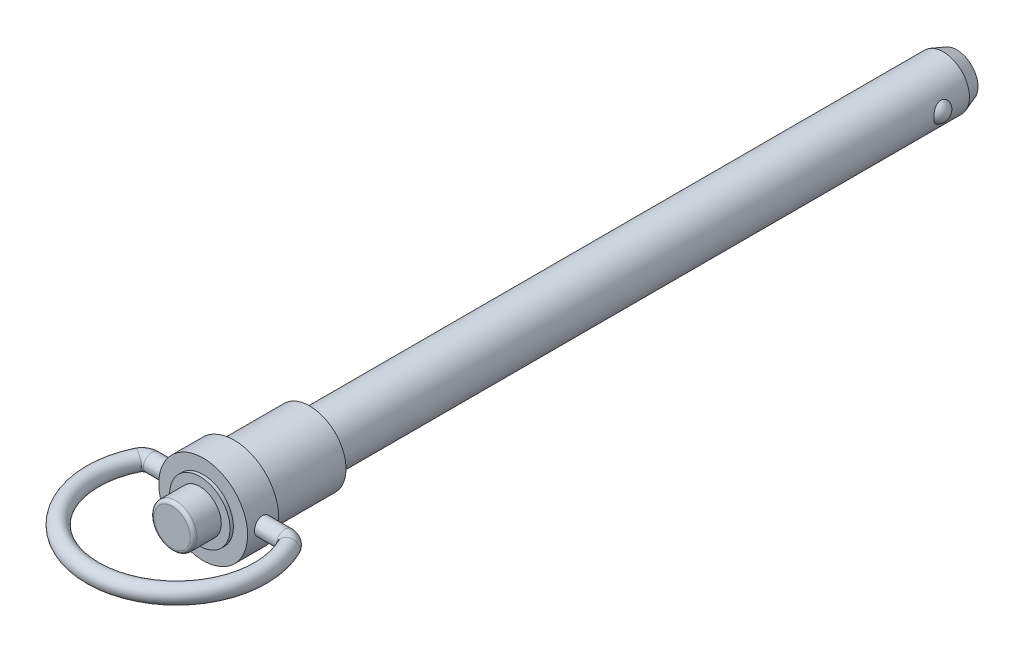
ISO-10303-21;
HEADER;
FILE_DESCRIPTION(('STEP AP214'),'2;1');
FILE_NAME('part.step','',(''),(''),'','','');
FILE_SCHEMA(('AUTOMOTIVE_DESIGN { 1 0 10303 214 1 1 1 1 }'));
ENDSEC;
DATA;
#1=APPLICATION_CONTEXT('core data for automotive mechanical design processes');
#2=APPLICATION_PROTOCOL_DEFINITION('international standard','automotive_design',2000,#1);
#3=PRODUCT_CONTEXT('',#1,'mechanical');
#4=PRODUCT('Part','Part','',(#3));
#5=PRODUCT_RELATED_PRODUCT_CATEGORY('part','',(#4));
#6=PRODUCT_DEFINITION_FORMATION('','',#4);
#7=PRODUCT_DEFINITION_CONTEXT('part definition',#1,'design');
#8=PRODUCT_DEFINITION('design','',#6,#7);
#9=PRODUCT_DEFINITION_SHAPE('','',#8);
#10=(LENGTH_UNIT() NAMED_UNIT(*) SI_UNIT(.MILLI.,.METRE.));
#11=(NAMED_UNIT(*) PLANE_ANGLE_UNIT() SI_UNIT($,.RADIAN.));
#12=(NAMED_UNIT(*) SI_UNIT($,.STERADIAN.) SOLID_ANGLE_UNIT());
#13=UNCERTAINTY_MEASURE_WITH_UNIT(LENGTH_MEASURE(1.E-05),#10,'distance_accuracy_value','');
#14=(GEOMETRIC_REPRESENTATION_CONTEXT(3) GLOBAL_UNCERTAINTY_ASSIGNED_CONTEXT((#13)) GLOBAL_UNIT_ASSIGNED_CONTEXT((#10,
#11,#12)) REPRESENTATION_CONTEXT('',''));
#15=CARTESIAN_POINT('',(0.,0.,0.));
#16=DIRECTION('',(0.,0.,1.));
#17=DIRECTION('',(1.,0.,0.));
#18=AXIS2_PLACEMENT_3D('',#15,#16,#17);
#19=CARTESIAN_POINT('',(0.,0.,20.828));
#20=DIRECTION('',(0.,0.,1.));
#21=DIRECTION('',(0.,-1.,0.));
#22=AXIS2_PLACEMENT_3D('',#19,#20,#21);
#23=PLANE('',#22);
#24=CARTESIAN_POINT('',(0.,0.,20.828));
#25=DIRECTION('',(0.,0.,-1.));
#26=DIRECTION('',(0.,1.,0.));
#27=AXIS2_PLACEMENT_3D('',#24,#25,#26);
#28=CIRCLE('',#27,2.7432);
#29=CARTESIAN_POINT('',(0.,2.7432,20.828));
#30=VERTEX_POINT('',#29);
#31=CARTESIAN_POINT('',(0.,-2.7432,20.828));
#32=VERTEX_POINT('',#31);
#33=EDGE_CURVE('E34',#30,#32,#28,.T.);
#34=ORIENTED_EDGE('',*,*,#33,.F.);
#35=CARTESIAN_POINT('',(0.,0.,20.828));
#36=DIRECTION('',(0.,0.,-1.));
#37=DIRECTION('',(0.,-1.,0.));
#38=AXIS2_PLACEMENT_3D('',#35,#36,#37);
#39=CIRCLE('',#38,2.7432);
#40=EDGE_CURVE('E29',#32,#30,#39,.T.);
#41=ORIENTED_EDGE('',*,*,#40,.F.);
#42=EDGE_LOOP('',(#34,#41));
#43=FACE_BOUND('',#42,.T.);
#44=ADVANCED_FACE('F15',(#43),#23,.T.);
#45=CARTESIAN_POINT('',(0.,0.,20.32));
#46=DIRECTION('',(0.,0.,1.));
#47=DIRECTION('',(0.,-1.,0.));
#48=AXIS2_PLACEMENT_3D('',#45,#46,#47);
#49=TOROIDAL_SURFACE('',#48,2.7432,0.508);
#50=ORIENTED_EDGE('',*,*,#40,.T.);
#51=ORIENTED_EDGE('',*,*,#33,.T.);
#52=EDGE_LOOP('',(#50,#51));
#53=FACE_BOUND('',#52,.T.);
#54=CARTESIAN_POINT('',(0.,0.,20.32));
#55=DIRECTION('',(0.,0.,-1.));
#56=DIRECTION('',(0.,1.,0.));
#57=AXIS2_PLACEMENT_3D('',#54,#55,#56);
#58=CIRCLE('',#57,3.2512);
#59=CARTESIAN_POINT('',(0.,3.2512,20.32));
#60=VERTEX_POINT('',#59);
#61=EDGE_CURVE('E51',#60,#60,#58,.T.);
#62=ORIENTED_EDGE('',*,*,#61,.F.);
#63=EDGE_LOOP('',(#62));
#64=FACE_BOUND('',#63,.T.);
#65=ADVANCED_FACE('F40',(#53,#64),#49,.T.);
#66=CARTESIAN_POINT('',(0.,0.,20.828));
#67=DIRECTION('',(0.,0.,-1.));
#68=DIRECTION('',(0.,1.,0.));
#69=AXIS2_PLACEMENT_3D('',#66,#67,#68);
#70=CYLINDRICAL_SURFACE('',#69,3.2512);
#71=CARTESIAN_POINT('',(0.,0.,16.637));
#72=DIRECTION('',(0.,0.,-1.));
#73=DIRECTION('',(0.,1.,0.));
#74=AXIS2_PLACEMENT_3D('',#71,#72,#73);
#75=CIRCLE('',#74,3.2512);
#76=CARTESIAN_POINT('',(0.,3.2512,16.637));
#77=VERTEX_POINT('',#76);
#78=EDGE_CURVE('E60',#77,#77,#75,.T.);
#79=ORIENTED_EDGE('',*,*,#78,.F.);
#80=EDGE_LOOP('',(#79));
#81=FACE_BOUND('',#80,.T.);
#82=ORIENTED_EDGE('',*,*,#61,.T.);
#83=EDGE_LOOP('',(#82));
#84=FACE_BOUND('',#83,.T.);
#85=ADVANCED_FACE('F80',(#81,#84),#70,.T.);
#86=CARTESIAN_POINT('',(4.572,0.,16.637));
#87=DIRECTION('',(0.,0.,1.));
#88=DIRECTION('',(0.,-1.,0.));
#89=AXIS2_PLACEMENT_3D('',#86,#87,#88);
#90=PLANE('',#89);
#91=ORIENTED_EDGE('',*,*,#78,.T.);
#92=EDGE_LOOP('',(#91));
#93=FACE_BOUND('',#92,.T.);
#94=CARTESIAN_POINT('',(0.,0.,16.637));
#95=DIRECTION('',(0.,0.,-1.));
#96=DIRECTION('',(0.,1.,0.));
#97=AXIS2_PLACEMENT_3D('',#94,#95,#96);
#98=CIRCLE('',#97,4.572);
#99=CARTESIAN_POINT('',(0.,4.572,16.637));
#100=VERTEX_POINT('',#99);
#101=EDGE_CURVE('E64',#100,#100,#98,.T.);
#102=ORIENTED_EDGE('',*,*,#101,.F.);
#103=EDGE_LOOP('',(#102));
#104=FACE_BOUND('',#103,.T.);
#105=ADVANCED_FACE('F83',(#93,#104),#90,.T.);
#106=CARTESIAN_POINT('',(0.,0.,0.));
#107=DIRECTION('',(0.,0.,-1.));
#108=DIRECTION('',(0.,1.,0.));
#109=AXIS2_PLACEMENT_3D('',#106,#107,#108);
#110=CYLINDRICAL_SURFACE('',#109,4.572);
#111=ORIENTED_EDGE('',*,*,#101,.T.);
#112=EDGE_LOOP('',(#111));
#113=FACE_BOUND('',#112,.T.);
#114=CARTESIAN_POINT('',(0.,0.,16.129));
#115=DIRECTION('',(0.,0.,-1.));
#116=DIRECTION('',(0.,1.,0.));
#117=AXIS2_PLACEMENT_3D('',#114,#115,#116);
#118=CIRCLE('',#117,4.572);
#119=CARTESIAN_POINT('',(0.,4.572,16.129));
#120=VERTEX_POINT('',#119);
#121=EDGE_CURVE('E218',#120,#120,#118,.T.);
#122=ORIENTED_EDGE('',*,*,#121,.F.);
#123=EDGE_LOOP('',(#122));
#124=FACE_BOUND('',#123,.T.);
#125=ADVANCED_FACE('F182',(#113,#124),#110,.T.);
#126=CARTESIAN_POINT('',(6.731,0.,16.129));
#127=DIRECTION('',(0.,0.,1.));
#128=DIRECTION('',(0.,-1.,0.));
#129=AXIS2_PLACEMENT_3D('',#126,#127,#128);
#130=PLANE('',#129);
#131=CARTESIAN_POINT('',(0.,0.,16.129));
#132=DIRECTION('',(0.,0.,-1.));
#133=DIRECTION('',(0.,1.,0.));
#134=AXIS2_PLACEMENT_3D('',#131,#132,#133);
#135=CIRCLE('',#134,6.731);
#136=CARTESIAN_POINT('',(0.,6.731,16.129));
#137=VERTEX_POINT('',#136);
#138=EDGE_CURVE('E221',#137,#137,#135,.T.);
#139=ORIENTED_EDGE('',*,*,#138,.F.);
#140=EDGE_LOOP('',(#139));
#141=FACE_BOUND('',#140,.T.);
#142=ORIENTED_EDGE('',*,*,#121,.T.);
#143=EDGE_LOOP('',(#142));
#144=FACE_BOUND('',#143,.T.);
#145=ADVANCED_FACE('F171',(#141,#144),#130,.T.);
#146=CARTESIAN_POINT('',(0.,0.,0.));
#147=DIRECTION('',(0.,0.,-1.));
#148=DIRECTION('',(0.,1.,0.));
#149=AXIS2_PLACEMENT_3D('',#146,#147,#148);
#150=CYLINDRICAL_SURFACE('',#149,6.731);
#151=CARTESIAN_POINT('',(0.,0.,11.43));
#152=DIRECTION('',(0.,0.,-1.));
#153=DIRECTION('',(0.,1.,0.));
#154=AXIS2_PLACEMENT_3D('',#151,#152,#153);
#155=CIRCLE('',#154,6.731);
#156=CARTESIAN_POINT('',(0.,6.731,11.43));
#157=VERTEX_POINT('',#156);
#158=EDGE_CURVE('E223',#157,#157,#155,.T.);
#159=ORIENTED_EDGE('',*,*,#158,.F.);
#160=EDGE_LOOP('',(#159));
#161=FACE_BOUND('',#160,.T.);
#162=ORIENTED_EDGE('',*,*,#138,.T.);
#163=EDGE_LOOP('',(#162));
#164=FACE_BOUND('',#163,.T.);
#165=CARTESIAN_POINT('',(-6.6051722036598,1.2954,13.7922));
#166=CARTESIAN_POINT('',(-6.60517361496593,1.2953972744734,13.864236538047));
#167=CARTESIAN_POINT('',(-6.60636346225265,1.28937073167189,13.9363080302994));
#168=CARTESIAN_POINT('',(-6.61098794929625,1.26544153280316,14.0784162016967));
#169=CARTESIAN_POINT('',(-6.61442445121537,1.24752902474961,14.1484511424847));
#170=CARTESIAN_POINT('',(-6.62313895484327,1.20040052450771,14.2844095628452));
#171=CARTESIAN_POINT('',(-6.62841519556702,1.17119533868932,14.3503369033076));
#172=CARTESIAN_POINT('',(-6.64021258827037,1.10233951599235,14.4763528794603));
#173=CARTESIAN_POINT('',(-6.64673365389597,1.06268960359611,14.5364419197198));
#174=CARTESIAN_POINT('',(-6.66038139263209,0.973516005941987,14.6498669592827));
#175=CARTESIAN_POINT('',(-6.66751428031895,0.9238817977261,14.7031153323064));
#176=CARTESIAN_POINT('',(-6.68152715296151,0.816387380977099,14.8005834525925));
#177=CARTESIAN_POINT('',(-6.6884071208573,0.758526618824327,14.8448025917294));
#178=CARTESIAN_POINT('',(-6.7012057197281,0.635644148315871,14.9232944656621));
#179=CARTESIAN_POINT('',(-6.70711617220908,0.570568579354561,14.9574843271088));
#180=CARTESIAN_POINT('',(-6.71724013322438,0.435464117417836,15.014412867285));
#181=CARTESIAN_POINT('',(-6.72145378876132,0.365435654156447,15.0371525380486));
#182=CARTESIAN_POINT('',(-6.72766549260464,0.223321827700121,15.0702635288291));
#183=CARTESIAN_POINT('',(-6.72968999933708,0.151272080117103,15.0807826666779));
#184=CARTESIAN_POINT('',(-6.73138656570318,0.00640388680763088,15.089614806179));
#185=CARTESIAN_POINT('',(-6.73105883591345,-0.0664144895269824,15.0879289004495));
#186=CARTESIAN_POINT('',(-6.72810846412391,-0.209738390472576,15.072511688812));
#187=CARTESIAN_POINT('',(-6.72551615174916,-0.280261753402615,15.0589395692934));
#188=CARTESIAN_POINT('',(-6.71836197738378,-0.418011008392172,15.0203872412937));
#189=CARTESIAN_POINT('',(-6.71380004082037,-0.485236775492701,14.9954066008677));
#190=CARTESIAN_POINT('',(-6.70316878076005,-0.614941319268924,14.9345963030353));
#191=CARTESIAN_POINT('',(-6.69709072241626,-0.67738974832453,14.8987035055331));
#192=CARTESIAN_POINT('',(-6.68409856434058,-0.795436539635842,14.8171343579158));
#193=CARTESIAN_POINT('',(-6.677184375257,-0.851034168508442,14.7714569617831));
#194=CARTESIAN_POINT('',(-6.66315320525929,-0.954744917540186,14.6707395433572));
#195=CARTESIAN_POINT('',(-6.65603475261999,-1.00272266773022,14.6155602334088));
#196=CARTESIAN_POINT('',(-6.64250376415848,-1.08876420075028,14.4978679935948));
#197=CARTESIAN_POINT('',(-6.63609123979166,-1.12682782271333,14.4353549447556));
#198=CARTESIAN_POINT('',(-6.62469571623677,-1.19200234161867,14.3045844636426));
#199=CARTESIAN_POINT('',(-6.61971540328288,-1.21909269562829,14.2363165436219));
#200=CARTESIAN_POINT('',(-6.61178862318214,-1.26138008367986,14.0960804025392));
#201=CARTESIAN_POINT('',(-6.60884191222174,-1.27657854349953,14.0241126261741));
#202=CARTESIAN_POINT('',(-6.60536444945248,-1.29445125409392,13.8797427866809));
#203=CARTESIAN_POINT('',(-6.60479610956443,-1.29732037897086,13.8073657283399));
#204=CARTESIAN_POINT('',(-6.60603903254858,-1.29097613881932,13.6631669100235));
#205=CARTESIAN_POINT('',(-6.60785017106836,-1.28176340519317,13.5913451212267));
#206=CARTESIAN_POINT('',(-6.6136128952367,-1.25168453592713,13.4509418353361));
#207=CARTESIAN_POINT('',(-6.61754556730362,-1.23092132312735,13.3823374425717));
#208=CARTESIAN_POINT('',(-6.62709183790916,-1.17844042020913,13.249581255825));
#209=CARTESIAN_POINT('',(-6.63270556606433,-1.14672188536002,13.1854298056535));
#210=CARTESIAN_POINT('',(-6.6450665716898,-1.07278507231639,13.0625442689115));
#211=CARTESIAN_POINT('',(-6.65182676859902,-1.03044414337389,13.0038853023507));
#212=CARTESIAN_POINT('',(-6.66568301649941,-0.936629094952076,12.8944341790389));
#213=CARTESIAN_POINT('',(-6.67277909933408,-0.885154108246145,12.8436427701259));
#214=CARTESIAN_POINT('',(-6.68662882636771,-0.773660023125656,12.7506362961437));
#215=CARTESIAN_POINT('',(-6.69337621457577,-0.713530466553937,12.7085525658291));
#216=CARTESIAN_POINT('',(-6.70566168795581,-0.586941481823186,12.6350847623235));
#217=CARTESIAN_POINT('',(-6.71119982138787,-0.520482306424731,12.6037002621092));
#218=CARTESIAN_POINT('',(-6.72041595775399,-0.383476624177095,12.5527164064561));
#219=CARTESIAN_POINT('',(-6.72410395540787,-0.312954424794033,12.5330536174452));
#220=CARTESIAN_POINT('',(-6.72924701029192,-0.169530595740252,12.5058694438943));
#221=CARTESIAN_POINT('',(-6.7307023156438,-0.0966292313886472,12.4983467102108));
#222=CARTESIAN_POINT('',(-6.73121071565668,0.0482259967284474,12.4957052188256));
#223=CARTESIAN_POINT('',(-6.73030215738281,0.120176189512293,12.5003884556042));
#224=CARTESIAN_POINT('',(-6.72626496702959,0.26224403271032,12.5215909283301));
#225=CARTESIAN_POINT('',(-6.72313635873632,0.332361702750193,12.5381100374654));
#226=CARTESIAN_POINT('',(-6.71501101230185,0.468662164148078,12.5824301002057));
#227=CARTESIAN_POINT('',(-6.710017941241,0.534852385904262,12.6102089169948));
#228=CARTESIAN_POINT('',(-6.69870305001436,0.661661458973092,12.6762356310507));
#229=CARTESIAN_POINT('',(-6.69238113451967,0.722279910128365,12.7144842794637));
#230=CARTESIAN_POINT('',(-6.6789853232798,0.837208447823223,12.8010411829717));
#231=CARTESIAN_POINT('',(-6.67190155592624,0.891410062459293,12.8494919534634));
#232=CARTESIAN_POINT('',(-6.65784127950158,0.990982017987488,12.95478313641));
#233=CARTESIAN_POINT('',(-6.65086479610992,1.03635027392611,13.0116255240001));
#234=CARTESIAN_POINT('',(-6.63773378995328,1.11738877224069,13.1327559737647));
#235=CARTESIAN_POINT('',(-6.63158802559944,1.15295925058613,13.1971117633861));
#236=CARTESIAN_POINT('',(-6.62092027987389,1.21272619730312,13.3309847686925));
#237=CARTESIAN_POINT('',(-6.61639678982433,1.23693323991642,13.4004971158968));
#238=CARTESIAN_POINT('',(-6.61041337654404,1.26845390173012,13.5238636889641));
#239=CARTESIAN_POINT('',(-6.60845980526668,1.27854107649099,13.57700269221));
#240=CARTESIAN_POINT('',(-6.60583870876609,1.29201504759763,13.6841545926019));
#241=CARTESIAN_POINT('',(-6.60517114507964,1.29540204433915,13.7381674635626));
#242=CARTESIAN_POINT('',(-6.6051722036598,1.2954,13.7922));
#243=B_SPLINE_CURVE_WITH_KNOTS('',3,(#165,#166,#167,#168,#169,#170,#171,#172,#173,#174,#175,
#176,#177,#178,#179,#180,#181,#182,#183,#184,#185,#186,#187,#188,#189,#190,#191,#192,#193,#194,
#195,#196,#197,#198,#199,#200,#201,#202,#203,#204,#205,#206,#207,#208,#209,#210,#211,#212,#213,
#214,#215,#216,#217,#218,#219,#220,#221,#222,#223,#224,#225,#226,#227,#228,#229,#230,#231,#232,
#233,#234,#235,#236,#237,#238,#239,#240,#241,#242),.UNSPECIFIED.,.T.,.F.,(4,2,2,2,2,2,2,2,2,2,2,
2,2,2,2,2,2,2,2,2,2,2,2,2,2,2,2,2,2,2,2,2,2,2,2,2,2,2,4),(0.,0.215911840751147,
0.432002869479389,0.64788762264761,0.86375740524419,1.08216318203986,1.30058366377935,
1.52076118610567,1.74091962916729,1.95838638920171,2.1758336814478,2.39041258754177,
2.60499961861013,2.82085272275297,3.0367289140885,3.25609136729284,3.47545737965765,
3.69523218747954,3.91498064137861,4.13124273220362,4.34749352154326,4.56184753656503,
4.7762180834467,4.99318797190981,5.21017847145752,5.430235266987,5.65028327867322,
5.86912939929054,6.08795119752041,6.30324544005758,6.51853737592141,6.73340808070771,
6.94829420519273,7.16640910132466,7.38457541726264,7.60488731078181,7.82499378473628,
7.9869478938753,8.14889715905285),.UNSPECIFIED.);
#244=CARTESIAN_POINT('',(-6.6051722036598,1.2954,13.7922));
#245=VERTEX_POINT('',#244);
#246=EDGE_CURVE('E192',#245,#245,#243,.T.);
#247=ORIENTED_EDGE('',*,*,#246,.T.);
#248=EDGE_LOOP('',(#247));
#249=FACE_BOUND('',#248,.T.);
#250=CARTESIAN_POINT('',(6.6051722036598,1.2954,13.7922));
#251=CARTESIAN_POINT('',(6.60517361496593,1.2953972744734,13.720163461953));
#252=CARTESIAN_POINT('',(6.60636346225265,1.2893707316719,13.6480919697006));
#253=CARTESIAN_POINT('',(6.61098794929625,1.26544153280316,13.5059837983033));
#254=CARTESIAN_POINT('',(6.61442445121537,1.24752902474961,13.4359488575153));
#255=CARTESIAN_POINT('',(6.62313895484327,1.20040052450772,13.2999904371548));
#256=CARTESIAN_POINT('',(6.62841519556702,1.17119533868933,13.2340630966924));
#257=CARTESIAN_POINT('',(6.64021258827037,1.10233951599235,13.1080471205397));
#258=CARTESIAN_POINT('',(6.64673365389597,1.06268960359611,13.0479580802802));
#259=CARTESIAN_POINT('',(6.66038139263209,0.973516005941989,12.9345330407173));
#260=CARTESIAN_POINT('',(6.66751428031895,0.923881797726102,12.8812846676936));
#261=CARTESIAN_POINT('',(6.68152715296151,0.816387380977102,12.7838165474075));
#262=CARTESIAN_POINT('',(6.6884071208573,0.758526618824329,12.7395974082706));
#263=CARTESIAN_POINT('',(6.7012057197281,0.635644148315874,12.6611055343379));
#264=CARTESIAN_POINT('',(6.70711617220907,0.570568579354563,12.6269156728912));
#265=CARTESIAN_POINT('',(6.71724013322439,0.435464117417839,12.569987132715));
#266=CARTESIAN_POINT('',(6.72145378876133,0.36543565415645,12.5472474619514));
#267=CARTESIAN_POINT('',(6.72766549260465,0.223321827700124,12.5141364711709));
#268=CARTESIAN_POINT('',(6.72968999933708,0.151272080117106,12.5036173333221));
#269=CARTESIAN_POINT('',(6.73138656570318,0.00640388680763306,12.494785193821));
#270=CARTESIAN_POINT('',(6.73105883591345,-0.0664144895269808,12.4964710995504));
#271=CARTESIAN_POINT('',(6.72810846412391,-0.209738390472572,12.511888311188));
#272=CARTESIAN_POINT('',(6.72551615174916,-0.280261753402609,12.5254604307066));
#273=CARTESIAN_POINT('',(6.71836197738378,-0.418011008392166,12.5640127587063));
#274=CARTESIAN_POINT('',(6.71380004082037,-0.4852367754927,12.5889933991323));
#275=CARTESIAN_POINT('',(6.70316878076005,-0.614941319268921,12.6498036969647));
#276=CARTESIAN_POINT('',(6.69709072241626,-0.67738974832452,12.6856964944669));
#277=CARTESIAN_POINT('',(6.68409856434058,-0.795436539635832,12.7672656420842));
#278=CARTESIAN_POINT('',(6.677184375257,-0.851034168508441,12.8129430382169));
#279=CARTESIAN_POINT('',(6.66315320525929,-0.954744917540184,12.9136604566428));
#280=CARTESIAN_POINT('',(6.65603475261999,-1.00272266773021,12.9688397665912));
#281=CARTESIAN_POINT('',(6.64250376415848,-1.08876420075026,13.0865320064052));
#282=CARTESIAN_POINT('',(6.63609123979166,-1.12682782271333,13.1490450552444));
#283=CARTESIAN_POINT('',(6.62469571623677,-1.19200234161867,13.2798155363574));
#284=CARTESIAN_POINT('',(6.61971540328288,-1.21909269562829,13.3480834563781));
#285=CARTESIAN_POINT('',(6.61178862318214,-1.26138008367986,13.4883195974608));
#286=CARTESIAN_POINT('',(6.60884191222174,-1.27657854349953,13.5602873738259));
#287=CARTESIAN_POINT('',(6.60536444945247,-1.29445125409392,13.7046572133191));
#288=CARTESIAN_POINT('',(6.60479610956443,-1.29732037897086,13.7770342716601));
#289=CARTESIAN_POINT('',(6.60603903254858,-1.29097613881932,13.9212330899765));
#290=CARTESIAN_POINT('',(6.60785017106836,-1.28176340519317,13.9930548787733));
#291=CARTESIAN_POINT('',(6.6136128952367,-1.25168453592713,14.1334581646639));
#292=CARTESIAN_POINT('',(6.61754556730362,-1.23092132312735,14.2020625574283));
#293=CARTESIAN_POINT('',(6.62709183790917,-1.17844042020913,14.334818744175));
#294=CARTESIAN_POINT('',(6.63270556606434,-1.14672188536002,14.3989701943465));
#295=CARTESIAN_POINT('',(6.64506657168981,-1.07278507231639,14.5218557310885));
#296=CARTESIAN_POINT('',(6.65182676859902,-1.03044414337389,14.5805146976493));
#297=CARTESIAN_POINT('',(6.66568301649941,-0.936629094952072,14.6899658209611));
#298=CARTESIAN_POINT('',(6.67277909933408,-0.885154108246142,14.7407572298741));
#299=CARTESIAN_POINT('',(6.68662882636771,-0.773660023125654,14.8337637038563));
#300=CARTESIAN_POINT('',(6.69337621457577,-0.713530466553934,14.8758474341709));
#301=CARTESIAN_POINT('',(6.70566168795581,-0.586941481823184,14.9493152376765));
#302=CARTESIAN_POINT('',(6.71119982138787,-0.520482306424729,14.9806997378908));
#303=CARTESIAN_POINT('',(6.72041595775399,-0.383476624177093,15.0316835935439));
#304=CARTESIAN_POINT('',(6.72410395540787,-0.31295442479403,15.0513463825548));
#305=CARTESIAN_POINT('',(6.72924701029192,-0.169530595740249,15.0785305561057));
#306=CARTESIAN_POINT('',(6.7307023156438,-0.0966292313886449,15.0860532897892));
#307=CARTESIAN_POINT('',(6.73121071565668,0.0482259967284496,15.0886947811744));
#308=CARTESIAN_POINT('',(6.73030215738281,0.120176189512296,15.0840115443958));
#309=CARTESIAN_POINT('',(6.72626496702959,0.262244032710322,15.0628090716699));
#310=CARTESIAN_POINT('',(6.72313635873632,0.332361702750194,15.0462899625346));
#311=CARTESIAN_POINT('',(6.71501101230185,0.46866216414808,15.0019698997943));
#312=CARTESIAN_POINT('',(6.710017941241,0.534852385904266,14.9741910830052));
#313=CARTESIAN_POINT('',(6.69870305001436,0.661661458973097,14.9081643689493));
#314=CARTESIAN_POINT('',(6.69238113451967,0.722279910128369,14.8699157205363));
#315=CARTESIAN_POINT('',(6.6789853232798,0.837208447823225,14.7833588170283));
#316=CARTESIAN_POINT('',(6.67190155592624,0.891410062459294,14.7349080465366));
#317=CARTESIAN_POINT('',(6.65784127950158,0.990982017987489,14.62961686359));
#318=CARTESIAN_POINT('',(6.65086479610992,1.03635027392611,14.5727744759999));
#319=CARTESIAN_POINT('',(6.63773378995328,1.1173887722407,14.4516440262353));
#320=CARTESIAN_POINT('',(6.63158802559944,1.15295925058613,14.3872882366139));
#321=CARTESIAN_POINT('',(6.62092027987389,1.21272619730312,14.2534152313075));
#322=CARTESIAN_POINT('',(6.61639678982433,1.23693323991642,14.1839028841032));
#323=CARTESIAN_POINT('',(6.61041337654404,1.26845390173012,14.0605363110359));
#324=CARTESIAN_POINT('',(6.60845980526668,1.27854107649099,14.00739730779));
#325=CARTESIAN_POINT('',(6.60583870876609,1.29201504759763,13.9002454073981));
#326=CARTESIAN_POINT('',(6.60517114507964,1.29540204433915,13.8462325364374));
#327=CARTESIAN_POINT('',(6.6051722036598,1.2954,13.7922));
#328=B_SPLINE_CURVE_WITH_KNOTS('',3,(#250,#251,#252,#253,#254,#255,#256,#257,#258,#259,#260,
#261,#262,#263,#264,#265,#266,#267,#268,#269,#270,#271,#272,#273,#274,#275,#276,#277,#278,#279,
#280,#281,#282,#283,#284,#285,#286,#287,#288,#289,#290,#291,#292,#293,#294,#295,#296,#297,#298,
#299,#300,#301,#302,#303,#304,#305,#306,#307,#308,#309,#310,#311,#312,#313,#314,#315,#316,#317,
#318,#319,#320,#321,#322,#323,#324,#325,#326,#327),.UNSPECIFIED.,.T.,.F.,(4,2,2,2,2,2,2,2,2,2,2,
2,2,2,2,2,2,2,2,2,2,2,2,2,2,2,2,2,2,2,2,2,2,2,2,2,2,2,4),(0.,0.215911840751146,
0.432002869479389,0.64788762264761,0.86375740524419,1.08216318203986,1.30058366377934,
1.52076118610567,1.74091962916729,1.95838638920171,2.1758336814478,2.39041258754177,
2.60499961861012,2.82085272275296,3.0367289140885,3.25609136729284,3.47545737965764,
3.69523218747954,3.91498064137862,4.13124273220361,4.34749352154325,4.56184753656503,
4.77621808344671,4.99318797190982,5.21017847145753,5.43023526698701,5.65028327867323,
5.86912939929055,6.08795119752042,6.30324544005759,6.51853737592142,6.73340808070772,
6.94829420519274,7.16640910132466,7.38457541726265,7.60488731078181,7.82499378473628,
7.98694789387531,8.14889715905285),.UNSPECIFIED.);
#329=CARTESIAN_POINT('',(6.6051722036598,1.2954,13.7922));
#330=VERTEX_POINT('',#329);
#331=EDGE_CURVE('E199',#330,#330,#328,.T.);
#332=ORIENTED_EDGE('',*,*,#331,.T.);
#333=EDGE_LOOP('',(#332));
#334=FACE_BOUND('',#333,.T.);
#335=ADVANCED_FACE('F165',(#161,#164,#249,#334),#150,.T.);
#336=CARTESIAN_POINT('',(5.7785,0.,11.43));
#337=DIRECTION('',(0.,0.,-1.));
#338=DIRECTION('',(0.,1.,0.));
#339=AXIS2_PLACEMENT_3D('',#336,#337,#338);
#340=PLANE('',#339);
#341=CARTESIAN_POINT('',(0.,0.,11.43));
#342=DIRECTION('',(0.,0.,-1.));
#343=DIRECTION('',(0.,1.,0.));
#344=AXIS2_PLACEMENT_3D('',#341,#342,#343);
#345=CIRCLE('',#344,5.9);
#346=CARTESIAN_POINT('',(0.,5.9,11.43));
#347=VERTEX_POINT('',#346);
#348=EDGE_CURVE('E23',#347,#347,#345,.F.);
#349=ORIENTED_EDGE('',*,*,#348,.T.);
#350=EDGE_LOOP('',(#349));
#351=FACE_BOUND('',#350,.T.);
#352=ORIENTED_EDGE('',*,*,#158,.T.);
#353=EDGE_LOOP('',(#352));
#354=FACE_BOUND('',#353,.T.);
#355=ADVANCED_FACE('F88',(#351,#354),#340,.T.);
#356=CARTESIAN_POINT('',(10.0803124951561,0.,15.3162));
#357=DIRECTION('',(0.,1.,0.));
#358=DIRECTION('',(-1.,0.,0.));
#359=AXIS2_PLACEMENT_3D('',#356,#357,#358);
#360=TOROIDAL_SURFACE('',#359,1.524,1.2954);
#361=CARTESIAN_POINT('',(11.4549005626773,0.,14.658109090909));
#362=DIRECTION('',(-0.431818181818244,0.,-0.901960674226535));
#363=DIRECTION('',(0.901960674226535,0.,-0.431818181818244));
#364=AXIS2_PLACEMENT_3D('',#361,#362,#363);
#365=CIRCLE('',#364,1.2954);
#366=CARTESIAN_POINT('',(12.6233004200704,0.,14.0987318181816));
#367=VERTEX_POINT('',#366);
#368=EDGE_CURVE('E42',#367,#367,#365,.T.);
#369=ORIENTED_EDGE('',*,*,#368,.T.);
#370=EDGE_LOOP('',(#369));
#371=FACE_BOUND('',#370,.T.);
#372=CARTESIAN_POINT('',(10.0803124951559,0.,13.7922));
#373=DIRECTION('',(1.,0.,0.));
#374=DIRECTION('',(0.,1.,0.));
#375=AXIS2_PLACEMENT_3D('',#372,#373,#374);
#376=CIRCLE('',#375,1.2954);
#377=CARTESIAN_POINT('',(10.0803124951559,1.2954,13.7922));
#378=VERTEX_POINT('',#377);
#379=EDGE_CURVE('E57',#378,#378,#376,.F.);
#380=ORIENTED_EDGE('',*,*,#379,.F.);
#381=EDGE_LOOP('',(#380));
#382=FACE_BOUND('',#381,.T.);
#383=ADVANCED_FACE('F85',(#371,#382),#360,.T.);
#384=CARTESIAN_POINT('',(-10.0803124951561,0.,13.7922));
#385=DIRECTION('',(1.,0.,0.));
#386=DIRECTION('',(0.,1.,0.));
#387=AXIS2_PLACEMENT_3D('',#384,#385,#386);
#388=CYLINDRICAL_SURFACE('',#387,1.2954);
#389=ORIENTED_EDGE('',*,*,#331,.F.);
#390=EDGE_LOOP('',(#389));
#391=FACE_BOUND('',#390,.T.);
#392=ORIENTED_EDGE('',*,*,#379,.T.);
#393=EDGE_LOOP('',(#392));
#394=FACE_BOUND('',#393,.T.);
#395=ADVANCED_FACE('F77',(#391,#394),#388,.T.);
#396=CARTESIAN_POINT('',(0.,0.,20.1422));
#397=DIRECTION('',(0.,1.,0.));
#398=DIRECTION('',(-1.,0.,0.));
#399=AXIS2_PLACEMENT_3D('',#396,#397,#398);
#400=TOROIDAL_SURFACE('',#399,12.7,1.2954);
#401=CARTESIAN_POINT('',(-11.4549005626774,0.,14.658109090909));
#402=DIRECTION('',(-0.43181818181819,0.,0.901960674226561));
#403=DIRECTION('',(-0.901960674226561,0.,-0.43181818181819));
#404=AXIS2_PLACEMENT_3D('',#401,#402,#403);
#405=CIRCLE('',#404,1.2954);
#406=CARTESIAN_POINT('',(-12.6233004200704,0.,14.0987318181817));
#407=VERTEX_POINT('',#406);
#408=EDGE_CURVE('E54',#407,#407,#405,.F.);
#409=ORIENTED_EDGE('',*,*,#408,.F.);
#410=EDGE_LOOP('',(#409));
#411=FACE_BOUND('',#410,.T.);
#412=ORIENTED_EDGE('',*,*,#368,.F.);
#413=EDGE_LOOP('',(#412));
#414=FACE_BOUND('',#413,.T.);
#415=ADVANCED_FACE('F75',(#411,#414),#400,.T.);
#416=CARTESIAN_POINT('',(-10.0803124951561,0.,15.3162));
#417=DIRECTION('',(0.,1.,0.));
#418=DIRECTION('',(-1.,0.,0.));
#419=AXIS2_PLACEMENT_3D('',#416,#417,#418);
#420=TOROIDAL_SURFACE('',#419,1.524,1.2954);
#421=CARTESIAN_POINT('',(-10.0803124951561,0.,13.7922));
#422=DIRECTION('',(1.,0.,0.));
#423=DIRECTION('',(0.,1.,0.));
#424=AXIS2_PLACEMENT_3D('',#421,#422,#423);
#425=CIRCLE('',#424,1.2954);
#426=CARTESIAN_POINT('',(-10.0803124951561,1.2954,13.7922));
#427=VERTEX_POINT('',#426);
#428=EDGE_CURVE('E61',#427,#427,#425,.T.);
#429=ORIENTED_EDGE('',*,*,#428,.F.);
#430=EDGE_LOOP('',(#429));
#431=FACE_BOUND('',#430,.T.);
#432=ORIENTED_EDGE('',*,*,#408,.T.);
#433=EDGE_LOOP('',(#432));
#434=FACE_BOUND('',#433,.T.);
#435=ADVANCED_FACE('F70',(#431,#434),#420,.T.);
#436=CARTESIAN_POINT('',(-10.0803124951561,0.,13.7922));
#437=DIRECTION('',(1.,0.,0.));
#438=DIRECTION('',(0.,1.,0.));
#439=AXIS2_PLACEMENT_3D('',#436,#437,#438);
#440=CYLINDRICAL_SURFACE('',#439,1.2954);
#441=ORIENTED_EDGE('',*,*,#246,.F.);
#442=EDGE_LOOP('',(#441));
#443=FACE_BOUND('',#442,.T.);
#444=ORIENTED_EDGE('',*,*,#428,.T.);
#445=EDGE_LOOP('',(#444));
#446=FACE_BOUND('',#445,.T.);
#447=ADVANCED_FACE('F74',(#443,#446),#440,.T.);
#448=CARTESIAN_POINT('',(0.,0.,41.9451823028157));
#449=DIRECTION('',(0.,0.,-1.));
#450=DIRECTION('',(0.,1.,0.));
#451=AXIS2_PLACEMENT_3D('',#448,#449,#450);
#452=CYLINDRICAL_SURFACE('',#451,5.5);
#453=CARTESIAN_POINT('',(0.,0.,11.03));
#454=DIRECTION('',(0.,0.,-1.));
#455=DIRECTION('',(0.,1.,0.));
#456=AXIS2_PLACEMENT_3D('',#453,#454,#455);
#457=CIRCLE('',#456,5.5);
#458=CARTESIAN_POINT('',(0.,5.5,11.03));
#459=VERTEX_POINT('',#458);
#460=EDGE_CURVE('E9',#459,#459,#457,.T.);
#461=ORIENTED_EDGE('',*,*,#460,.T.);
#462=EDGE_LOOP('',(#461));
#463=FACE_BOUND('',#462,.T.);
#464=CARTESIAN_POINT('',(0.,0.,0.));
#465=DIRECTION('',(0.,0.,-1.));
#466=DIRECTION('',(0.,1.,0.));
#467=AXIS2_PLACEMENT_3D('',#464,#465,#466);
#468=CIRCLE('',#467,5.5);
#469=CARTESIAN_POINT('',(0.,5.5,0.));
#470=VERTEX_POINT('',#469);
#471=EDGE_CURVE('E200',#470,#470,#468,.T.);
#472=ORIENTED_EDGE('',*,*,#471,.F.);
#473=EDGE_LOOP('',(#472));
#474=FACE_BOUND('',#473,.T.);
#475=ADVANCED_FACE('F189',(#463,#474),#452,.T.);
#476=CARTESIAN_POINT('',(3.22979748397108,0.,-97.9908));
#477=DIRECTION('',(0.,0.,1.));
#478=DIRECTION('',(0.,-1.,0.));
#479=AXIS2_PLACEMENT_3D('',#476,#477,#478);
#480=PLANE('',#479);
#481=CARTESIAN_POINT('',(0.,0.,-97.9907999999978));
#482=DIRECTION('',(0.,0.,1.));
#483=DIRECTION('',(0.,-1.,0.));
#484=AXIS2_PLACEMENT_3D('',#481,#482,#483);
#485=CIRCLE('',#484,3.22979748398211);
#486=CARTESIAN_POINT('',(0.,-3.22979748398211,-97.9907999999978));
#487=VERTEX_POINT('',#486);
#488=EDGE_CURVE('E120',#487,#487,#485,.T.);
#489=ORIENTED_EDGE('',*,*,#488,.F.);
#490=EDGE_LOOP('',(#489));
#491=FACE_BOUND('',#490,.T.);
#492=ADVANCED_FACE('F131',(#491),#480,.F.);
#493=CARTESIAN_POINT('',(3.12293,0.,-91.8948));
#494=DIRECTION('',(0.,0.,1.));
#495=DIRECTION('',(1.,0.,0.));
#496=AXIS2_PLACEMENT_3D('',#493,#494,#495);
#497=SPHERICAL_SURFACE('',#496,1.5875);
#498=CARTESIAN_POINT('',(3.969385,0.,-90.5517921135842));
#499=CARTESIAN_POINT('',(3.96938133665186,0.0871787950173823,-90.5517940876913));
#500=CARTESIAN_POINT('',(3.96648576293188,0.174428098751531,-90.5584820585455));
#501=CARTESIAN_POINT('',(3.95516905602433,0.346584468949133,-90.5851998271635));
#502=CARTESIAN_POINT('',(3.94674017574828,0.431488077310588,-90.6052483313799));
#503=CARTESIAN_POINT('',(3.92519423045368,0.596479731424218,-90.6585272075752));
#504=CARTESIAN_POINT('',(3.91207555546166,0.676566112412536,-90.6917621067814));
#505=CARTESIAN_POINT('',(3.88253654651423,0.82945224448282,-90.7710588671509));
#506=CARTESIAN_POINT('',(3.86611699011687,0.90225370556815,-90.8171177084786));
#507=CARTESIAN_POINT('',(3.83222363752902,1.03672093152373,-90.9203356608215));
#508=CARTESIAN_POINT('',(3.81477966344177,1.0985904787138,-90.9772380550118));
#509=CARTESIAN_POINT('',(3.78068495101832,1.21073548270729,-91.1017462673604));
#510=CARTESIAN_POINT('',(3.76403384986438,1.26101628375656,-91.1693471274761));
#511=CARTESIAN_POINT('',(3.73507217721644,1.34426479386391,-91.3077911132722));
#512=CARTESIAN_POINT('',(3.72252093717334,1.37829571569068,-91.3779422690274));
#513=CARTESIAN_POINT('',(3.70178973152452,1.43305274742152,-91.5238520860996));
#514=CARTESIAN_POINT('',(3.69360549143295,1.45379187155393,-91.5996051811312));
#515=CARTESIAN_POINT('',(3.68341966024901,1.47939277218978,-91.7454817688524));
#516=CARTESIAN_POINT('',(3.680835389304,1.4857542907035,-91.8153038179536));
#517=CARTESIAN_POINT('',(3.68040725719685,1.48681628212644,-91.9550414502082));
#518=CARTESIAN_POINT('',(3.68256179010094,1.48152070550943,-92.0249569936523));
#519=CARTESIAN_POINT('',(3.69108766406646,1.4601393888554,-92.1588086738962));
#520=CARTESIAN_POINT('',(3.69721728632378,1.4446714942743,-92.2228608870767));
#521=CARTESIAN_POINT('',(3.71278611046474,1.40417367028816,-92.3474287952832));
#522=CARTESIAN_POINT('',(3.72222570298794,1.37914261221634,-92.4079440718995));
#523=CARTESIAN_POINT('',(3.74389633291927,1.3192072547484,-92.5264268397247));
#524=CARTESIAN_POINT('',(3.75622345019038,1.28394990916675,-92.5841973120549));
#525=CARTESIAN_POINT('',(3.78224213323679,1.20514746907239,-92.6934181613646));
#526=CARTESIAN_POINT('',(3.79593412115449,1.1615998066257,-92.7448665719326));
#527=CARTESIAN_POINT('',(3.82484228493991,1.06277839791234,-92.8454045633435));
#528=CARTESIAN_POINT('',(3.84007638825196,1.00677387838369,-92.8937694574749));
#529=CARTESIAN_POINT('',(3.86933265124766,0.887713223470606,-92.9813922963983));
#530=CARTESIAN_POINT('',(3.88335410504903,0.824653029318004,-93.0206449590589));
#531=CARTESIAN_POINT('',(3.90318345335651,0.722863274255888,-93.0740110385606));
#532=CARTESIAN_POINT('',(3.90984058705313,0.686009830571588,-93.0914710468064));
#533=CARTESIAN_POINT('',(3.92226926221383,0.610957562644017,-93.123476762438));
#534=CARTESIAN_POINT('',(3.92804156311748,0.572759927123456,-93.1380249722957));
#535=CARTESIAN_POINT('',(3.94381689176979,0.456514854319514,-93.1772484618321));
#536=CARTESIAN_POINT('',(3.95229851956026,0.376714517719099,-93.1975549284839));
#537=CARTESIAN_POINT('',(3.96199329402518,0.247044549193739,-93.2205332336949));
#538=CARTESIAN_POINT('',(3.96475587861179,0.197910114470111,-93.2270073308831));
#539=CARTESIAN_POINT('',(3.96845279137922,0.0991914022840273,-93.2356452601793));
#540=CARTESIAN_POINT('',(3.96938708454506,0.0496071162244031,-93.2378090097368));
#541=CARTESIAN_POINT('',(3.96938133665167,-0.0871787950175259,-93.2378059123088));
#542=CARTESIAN_POINT('',(3.96648576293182,-0.174428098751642,-93.2311179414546));
#543=CARTESIAN_POINT('',(3.95516905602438,-0.346584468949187,-93.2044001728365));
#544=CARTESIAN_POINT('',(3.94674017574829,-0.431488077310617,-93.1843516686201));
#545=CARTESIAN_POINT('',(3.92519423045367,-0.596479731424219,-93.1310727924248));
#546=CARTESIAN_POINT('',(3.91207555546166,-0.676566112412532,-93.0978378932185));
#547=CARTESIAN_POINT('',(3.88253654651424,-0.829452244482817,-93.0185411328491));
#548=CARTESIAN_POINT('',(3.86611699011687,-0.902253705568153,-92.9724822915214));
#549=CARTESIAN_POINT('',(3.83222363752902,-1.03672093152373,-92.8692643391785));
#550=CARTESIAN_POINT('',(3.81477966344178,-1.0985904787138,-92.8123619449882));
#551=CARTESIAN_POINT('',(3.78068495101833,-1.21073548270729,-92.6878537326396));
#552=CARTESIAN_POINT('',(3.76403384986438,-1.26101628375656,-92.6202528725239));
#553=CARTESIAN_POINT('',(3.73507217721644,-1.34426479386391,-92.4818088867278));
#554=CARTESIAN_POINT('',(3.72252093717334,-1.37829571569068,-92.4116577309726));
#555=CARTESIAN_POINT('',(3.70178973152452,-1.43305274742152,-92.2657479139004));
#556=CARTESIAN_POINT('',(3.69360549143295,-1.45379187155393,-92.1899948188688));
#557=CARTESIAN_POINT('',(3.68341966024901,-1.47939277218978,-92.0441182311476));
#558=CARTESIAN_POINT('',(3.680835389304,-1.4857542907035,-91.9742961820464));
#559=CARTESIAN_POINT('',(3.68040725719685,-1.48681628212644,-91.8345585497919));
#560=CARTESIAN_POINT('',(3.68256179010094,-1.48152070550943,-91.7646430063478));
#561=CARTESIAN_POINT('',(3.69108766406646,-1.4601393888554,-91.6307913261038));
#562=CARTESIAN_POINT('',(3.69721728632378,-1.44467149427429,-91.5667391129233));
#563=CARTESIAN_POINT('',(3.71278611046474,-1.40417367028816,-91.4421712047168));
#564=CARTESIAN_POINT('',(3.72222570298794,-1.37914261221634,-91.3816559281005));
#565=CARTESIAN_POINT('',(3.74389633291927,-1.31920725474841,-91.2631731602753));
#566=CARTESIAN_POINT('',(3.75622345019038,-1.28394990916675,-91.2054026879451));
#567=CARTESIAN_POINT('',(3.78224213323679,-1.20514746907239,-91.0961818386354));
#568=CARTESIAN_POINT('',(3.79593412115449,-1.1615998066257,-91.0447334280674));
#569=CARTESIAN_POINT('',(3.82484228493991,-1.06277839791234,-90.9441954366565));
#570=CARTESIAN_POINT('',(3.84007638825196,-1.00677387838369,-90.8958305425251));
#571=CARTESIAN_POINT('',(3.86933265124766,-0.887713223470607,-90.8082077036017));
#572=CARTESIAN_POINT('',(3.88335410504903,-0.824653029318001,-90.7689550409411));
#573=CARTESIAN_POINT('',(3.90318345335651,-0.722863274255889,-90.7155889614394));
#574=CARTESIAN_POINT('',(3.90984058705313,-0.686009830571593,-90.6981289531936));
#575=CARTESIAN_POINT('',(3.92226926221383,-0.61095756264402,-90.666123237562));
#576=CARTESIAN_POINT('',(3.92804156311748,-0.572759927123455,-90.6515750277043));
#577=CARTESIAN_POINT('',(3.94381689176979,-0.456514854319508,-90.6123515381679));
#578=CARTESIAN_POINT('',(3.95229851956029,-0.376714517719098,-90.5920450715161));
#579=CARTESIAN_POINT('',(3.96199329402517,-0.24704454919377,-90.5690667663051));
#580=CARTESIAN_POINT('',(3.96475587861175,-0.197910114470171,-90.5625926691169));
#581=CARTESIAN_POINT('',(3.96845279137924,-0.0991914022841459,-90.5539547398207));
#582=CARTESIAN_POINT('',(3.96938708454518,-0.0496071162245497,-90.5517909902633));
#583=CARTESIAN_POINT('',(3.969385,0.,-90.5517921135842));
#584=B_SPLINE_CURVE_WITH_KNOTS('',3,(#498,#499,#500,#501,#502,#503,#504,#505,#506,#507,#508,
#509,#510,#511,#512,#513,#514,#515,#516,#517,#518,#519,#520,#521,#522,#523,#524,#525,#526,#527,
#528,#529,#530,#531,#532,#533,#534,#535,#536,#537,#538,#539,#540,#541,#542,#543,#544,#545,#546,
#547,#548,#549,#550,#551,#552,#553,#554,#555,#556,#557,#558,#559,#560,#561,#562,#563,#564,#565,
#566,#567,#568,#569,#570,#571,#572,#573,#574,#575,#576,#577,#578,#579,#580,#581,#582,#583),
.UNSPECIFIED.,.T.,.F.,(4,2,2,2,2,2,2,2,2,2,2,2,2,2,2,2,2,2,2,2,2,2,2,2,2,2,2,2,2,2,2,2,2,2,2,2,
2,2,2,2,2,2,4),(0.,0.261355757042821,0.523078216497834,0.784890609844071,1.04664140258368,
1.30282923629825,1.55889868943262,1.79448362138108,2.02983753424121,2.2392155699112,
2.44852266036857,2.64616391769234,2.84382850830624,3.04935366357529,3.25494258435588,
3.48066948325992,3.70652690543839,3.83036514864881,3.95409650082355,4.20121716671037,
4.34993288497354,4.49865145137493,4.76000720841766,5.0217296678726,5.28354206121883,
5.54529285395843,5.80148068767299,6.05755014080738,6.29313507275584,6.52848898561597,
6.73786702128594,6.94717411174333,7.1448153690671,7.34247995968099,7.54800511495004,
7.75359403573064,7.97932093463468,8.20517835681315,8.32901660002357,8.45274795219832,
8.69986861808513,8.84858433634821,8.99730290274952),.UNSPECIFIED.);
#585=CARTESIAN_POINT('',(3.969385,0.,-90.5517921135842));
#586=VERTEX_POINT('',#585);
#587=EDGE_CURVE('E136',#586,#586,#584,.T.);
#588=ORIENTED_EDGE('',*,*,#587,.F.);
#589=EDGE_LOOP('',(#588));
#590=FACE_BOUND('',#589,.T.);
#591=ADVANCED_FACE('F126',(#590),#497,.T.);
#592=CARTESIAN_POINT('',(-3.12207,0.,-91.8948));
#593=DIRECTION('',(0.,0.,1.));
#594=DIRECTION('',(1.,0.,0.));
#595=AXIS2_PLACEMENT_3D('',#592,#593,#594);
#596=SPHERICAL_SURFACE('',#595,1.5875);
#597=CARTESIAN_POINT('',(-3.969385,0.,-93.2372654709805));
#598=CARTESIAN_POINT('',(-3.96938133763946,0.0871655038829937,-93.2372634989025));
#599=CARTESIAN_POINT('',(-3.96648664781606,0.174401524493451,-93.2305767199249));
#600=CARTESIAN_POINT('',(-3.95517337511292,0.346531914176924,-93.2038635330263));
#601=CARTESIAN_POINT('',(-3.94674704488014,0.431422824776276,-93.1838184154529));
#602=CARTESIAN_POINT('',(-3.92520757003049,0.5963902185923,-93.130547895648));
#603=CARTESIAN_POINT('',(-3.91209280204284,0.676465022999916,-93.0973179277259));
#604=CARTESIAN_POINT('',(-3.88256269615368,0.829328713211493,-93.0180318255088));
#605=CARTESIAN_POINT('',(-3.86614813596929,0.902119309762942,-92.9719787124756));
#606=CARTESIAN_POINT('',(-3.83226668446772,1.03656073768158,-92.8687753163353));
#607=CARTESIAN_POINT('',(-3.81482968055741,1.09841593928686,-92.8118824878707));
#608=CARTESIAN_POINT('',(-3.78074977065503,1.21053228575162,-92.6873942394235));
#609=CARTESIAN_POINT('',(-3.76410650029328,1.26079879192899,-92.6198037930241));
#610=CARTESIAN_POINT('',(-3.73516296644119,1.3440117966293,-92.4813917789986));
#611=CARTESIAN_POINT('',(-3.72262152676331,1.37802358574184,-92.4112633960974));
#612=CARTESIAN_POINT('',(-3.70190880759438,1.43274470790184,-92.2654021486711));
#613=CARTESIAN_POINT('',(-3.69373324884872,1.45346707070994,-92.1896748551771));
#614=CARTESIAN_POINT('',(-3.68356253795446,1.47903682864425,-92.0438593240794));
#615=CARTESIAN_POINT('',(-3.68098431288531,1.48538528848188,-91.974072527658));
#616=CARTESIAN_POINT('',(-3.68056466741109,1.48642656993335,-91.8344074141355));
#617=CARTESIAN_POINT('',(-3.68272164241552,1.48112333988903,-91.764529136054));
#618=CARTESIAN_POINT('',(-3.69124841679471,1.45973298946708,-91.6307514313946));
#619=CARTESIAN_POINT('',(-3.69737666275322,1.44426351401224,-91.5667358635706));
#620=CARTESIAN_POINT('',(-3.71293936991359,1.40376833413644,-91.442240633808));
#621=CARTESIAN_POINT('',(-3.7223742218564,1.37874150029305,-91.3817613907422));
#622=CARTESIAN_POINT('',(-3.74403310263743,1.31881886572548,-91.2633463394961));
#623=CARTESIAN_POINT('',(-3.75635326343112,1.28356966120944,-91.2056078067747));
#624=CARTESIAN_POINT('',(-3.78235625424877,1.20478881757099,-91.0964482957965));
#625=CARTESIAN_POINT('',(-3.79603950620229,1.16125461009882,-91.0450292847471));
#626=CARTESIAN_POINT('',(-3.8249299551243,1.06246208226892,-90.9445443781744));
#627=CARTESIAN_POINT('',(-3.84015502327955,1.00647273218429,-90.8962035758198));
#628=CARTESIAN_POINT('',(-3.86939345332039,0.887446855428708,-90.8086250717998));
#629=CARTESIAN_POINT('',(-3.88340610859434,0.824406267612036,-90.7693926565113));
#630=CARTESIAN_POINT('',(-3.90322364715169,0.722645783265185,-90.716052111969));
#631=CARTESIAN_POINT('',(-3.9098772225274,0.685800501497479,-90.6985993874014));
#632=CARTESIAN_POINT('',(-3.92229912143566,0.610765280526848,-90.6666073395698));
#633=CARTESIAN_POINT('',(-3.92806820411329,0.572576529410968,-90.652065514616));
#634=CARTESIAN_POINT('',(-3.94383454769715,0.456359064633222,-90.6128596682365));
#635=CARTESIAN_POINT('',(-3.95231106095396,0.376578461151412,-90.5925629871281));
#636=CARTESIAN_POINT('',(-3.96199909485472,0.246947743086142,-90.5695978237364));
#637=CARTESIAN_POINT('',(-3.96475951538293,0.197832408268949,-90.5631279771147));
#638=CARTESIAN_POINT('',(-3.9684535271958,0.0991523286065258,-90.5544957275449));
#639=CARTESIAN_POINT('',(-3.96938708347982,0.0495875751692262,-90.5523334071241));
#640=CARTESIAN_POINT('',(-3.96938133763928,-0.0871655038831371,-90.5523365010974));
#641=CARTESIAN_POINT('',(-3.96648664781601,-0.174401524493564,-90.5590232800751));
#642=CARTESIAN_POINT('',(-3.95517337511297,-0.346531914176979,-90.5857364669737));
#643=CARTESIAN_POINT('',(-3.94674704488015,-0.431422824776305,-90.6057815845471));
#644=CARTESIAN_POINT('',(-3.92520757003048,-0.596390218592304,-90.659052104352));
#645=CARTESIAN_POINT('',(-3.91209280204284,-0.676465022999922,-90.6922820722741));
#646=CARTESIAN_POINT('',(-3.88256269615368,-0.829328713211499,-90.7715681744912));
#647=CARTESIAN_POINT('',(-3.86614813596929,-0.902119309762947,-90.8176212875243));
#648=CARTESIAN_POINT('',(-3.83226668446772,-1.03656073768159,-90.9208246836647));
#649=CARTESIAN_POINT('',(-3.81482968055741,-1.09841593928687,-90.9777175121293));
#650=CARTESIAN_POINT('',(-3.78074977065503,-1.21053228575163,-91.1022057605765));
#651=CARTESIAN_POINT('',(-3.76410650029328,-1.260798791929,-91.1697962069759));
#652=CARTESIAN_POINT('',(-3.73516296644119,-1.3440117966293,-91.3082082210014));
#653=CARTESIAN_POINT('',(-3.72262152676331,-1.37802358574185,-91.3783366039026));
#654=CARTESIAN_POINT('',(-3.70190880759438,-1.43274470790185,-91.5241978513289));
#655=CARTESIAN_POINT('',(-3.69373324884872,-1.45346707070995,-91.5999251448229));
#656=CARTESIAN_POINT('',(-3.68356253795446,-1.47903682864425,-91.7457406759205));
#657=CARTESIAN_POINT('',(-3.68098431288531,-1.48538528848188,-91.815527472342));
#658=CARTESIAN_POINT('',(-3.68056466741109,-1.48642656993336,-91.9551925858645));
#659=CARTESIAN_POINT('',(-3.68272164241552,-1.48112333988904,-92.025070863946));
#660=CARTESIAN_POINT('',(-3.69124841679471,-1.45973298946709,-92.1588485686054));
#661=CARTESIAN_POINT('',(-3.69737666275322,-1.44426351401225,-92.2228641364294));
#662=CARTESIAN_POINT('',(-3.71293936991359,-1.40376833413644,-92.347359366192));
#663=CARTESIAN_POINT('',(-3.7223742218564,-1.37874150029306,-92.4078386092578));
#664=CARTESIAN_POINT('',(-3.74403310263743,-1.31881886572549,-92.5262536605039));
#665=CARTESIAN_POINT('',(-3.75635326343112,-1.28356966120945,-92.5839921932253));
#666=CARTESIAN_POINT('',(-3.78235625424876,-1.204788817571,-92.6931517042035));
#667=CARTESIAN_POINT('',(-3.79603950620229,-1.16125461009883,-92.7445707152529));
#668=CARTESIAN_POINT('',(-3.8249299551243,-1.06246208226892,-92.8450556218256));
#669=CARTESIAN_POINT('',(-3.84015502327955,-1.00647273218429,-92.8933964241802));
#670=CARTESIAN_POINT('',(-3.86939345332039,-0.88744685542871,-92.9809749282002));
#671=CARTESIAN_POINT('',(-3.88340610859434,-0.824406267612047,-93.0202073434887));
#672=CARTESIAN_POINT('',(-3.90322364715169,-0.722645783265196,-93.073547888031));
#673=CARTESIAN_POINT('',(-3.9098772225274,-0.685800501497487,-93.0910006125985));
#674=CARTESIAN_POINT('',(-3.92229912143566,-0.610765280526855,-93.1229926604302));
#675=CARTESIAN_POINT('',(-3.92806820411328,-0.572576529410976,-93.137534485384));
#676=CARTESIAN_POINT('',(-3.94383454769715,-0.456359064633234,-93.1767403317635));
#677=CARTESIAN_POINT('',(-3.95231106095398,-0.376578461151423,-93.1970370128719));
#678=CARTESIAN_POINT('',(-3.96199909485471,-0.246947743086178,-93.2200021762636));
#679=CARTESIAN_POINT('',(-3.96475951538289,-0.197832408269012,-93.2264720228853));
#680=CARTESIAN_POINT('',(-3.96845352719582,-0.0991523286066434,-93.235104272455));
#681=CARTESIAN_POINT('',(-3.96938708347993,-0.0495875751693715,-93.2372665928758));
#682=CARTESIAN_POINT('',(-3.969385,0.,-93.2372654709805));
#683=B_SPLINE_CURVE_WITH_KNOTS('',3,(#597,#598,#599,#600,#601,#602,#603,#604,#605,#606,#607,
#608,#609,#610,#611,#612,#613,#614,#615,#616,#617,#618,#619,#620,#621,#622,#623,#624,#625,#626,
#627,#628,#629,#630,#631,#632,#633,#634,#635,#636,#637,#638,#639,#640,#641,#642,#643,#644,#645,
#646,#647,#648,#649,#650,#651,#652,#653,#654,#655,#656,#657,#658,#659,#660,#661,#662,#663,#664,
#665,#666,#667,#668,#669,#670,#671,#672,#673,#674,#675,#676,#677,#678,#679,#680,#681,#682),
.UNSPECIFIED.,.T.,.F.,(4,2,2,2,2,2,2,2,2,2,2,2,2,2,2,2,2,2,2,2,2,2,2,2,2,2,2,2,2,2,2,2,2,2,2,2,
2,2,2,2,2,2,4),(0.,0.261315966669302,0.522998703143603,0.784772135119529,1.04648394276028,
1.30261745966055,1.55863224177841,1.79412729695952,2.02939110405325,2.23866021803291,
2.44785842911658,2.64539457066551,2.84295406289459,3.04838300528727,3.2538757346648,
3.47951765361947,3.70529020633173,3.82909570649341,3.9527943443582,4.19984978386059,
4.34850695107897,4.49716696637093,4.75848293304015,5.02016566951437,5.28193910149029,
5.54365090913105,5.79978442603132,6.05579920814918,6.29129426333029,6.52655807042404,
6.73582718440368,6.94502539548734,7.14256153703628,7.34012102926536,7.54554997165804,
7.75104270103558,7.97668461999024,8.20245717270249,8.32626267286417,8.44996131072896,
8.69701675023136,8.84567391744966,8.99433393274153),.UNSPECIFIED.);
#684=CARTESIAN_POINT('',(-3.969385,0.,-93.2372654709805));
#685=VERTEX_POINT('',#684);
#686=EDGE_CURVE('E145',#685,#685,#683,.T.);
#687=ORIENTED_EDGE('',*,*,#686,.F.);
#688=EDGE_LOOP('',(#687));
#689=FACE_BOUND('',#688,.T.);
#690=ADVANCED_FACE('F130',(#689),#596,.T.);
#691=CARTESIAN_POINT('',(0.,0.,-95.9587999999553));
#692=DIRECTION('',(0.,0.,1.));
#693=DIRECTION('',(0.,-1.,0.));
#694=AXIS2_PLACEMENT_3D('',#691,#692,#693);
#695=CONICAL_SURFACE('',#694,3.9693850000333,0.349065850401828);
#696=ORIENTED_EDGE('',*,*,#488,.T.);
#697=EDGE_LOOP('',(#696));
#698=FACE_BOUND('',#697,.T.);
#699=CARTESIAN_POINT('',(0.,0.,-95.9588));
#700=DIRECTION('',(0.,0.,1.));
#701=DIRECTION('',(0.,-1.,0.));
#702=AXIS2_PLACEMENT_3D('',#699,#700,#701);
#703=CIRCLE('',#702,3.969385);
#704=CARTESIAN_POINT('',(0.,-3.969385,-95.9588));
#705=VERTEX_POINT('',#704);
#706=EDGE_CURVE('E144',#705,#705,#703,.T.);
#707=ORIENTED_EDGE('',*,*,#706,.F.);
#708=EDGE_LOOP('',(#707));
#709=FACE_BOUND('',#708,.T.);
#710=ADVANCED_FACE('F133',(#698,#709),#695,.T.);
#711=CARTESIAN_POINT('',(0.,0.,-70.));
#712=DIRECTION('',(0.,0.,1.));
#713=DIRECTION('',(-0.810321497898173,-0.585985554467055,0.));
#714=AXIS2_PLACEMENT_3D('',#711,#712,#713);
#715=CYLINDRICAL_SURFACE('',#714,3.969385);
#716=ORIENTED_EDGE('',*,*,#706,.T.);
#717=EDGE_LOOP('',(#716));
#718=FACE_BOUND('',#717,.T.);
#719=ORIENTED_EDGE('',*,*,#686,.T.);
#720=EDGE_LOOP('',(#719));
#721=FACE_BOUND('',#720,.T.);
#722=ORIENTED_EDGE('',*,*,#587,.T.);
#723=EDGE_LOOP('',(#722));
#724=FACE_BOUND('',#723,.T.);
#725=CARTESIAN_POINT('',(0.,0.,0.));
#726=DIRECTION('',(0.,0.,-1.));
#727=DIRECTION('',(0.,1.,0.));
#728=AXIS2_PLACEMENT_3D('',#725,#726,#727);
#729=CIRCLE('',#728,3.969385);
#730=CARTESIAN_POINT('',(0.,3.96938500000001,0.));
#731=VERTEX_POINT('',#730);
#732=EDGE_CURVE('E36',#731,#731,#729,.T.);
#733=ORIENTED_EDGE('',*,*,#732,.T.);
#734=EDGE_LOOP('',(#733));
#735=FACE_BOUND('',#734,.T.);
#736=ADVANCED_FACE('F151',(#718,#721,#724,#735),#715,.T.);
#737=CARTESIAN_POINT('',(0.,0.,0.));
#738=DIRECTION('',(0.,0.,-1.));
#739=DIRECTION('',(0.,1.,0.));
#740=AXIS2_PLACEMENT_3D('',#737,#738,#739);
#741=PLANE('',#740);
#742=ORIENTED_EDGE('',*,*,#732,.F.);
#743=EDGE_LOOP('',(#742));
#744=FACE_BOUND('',#743,.T.);
#745=ORIENTED_EDGE('',*,*,#471,.T.);
#746=EDGE_LOOP('',(#745));
#747=FACE_BOUND('',#746,.T.);
#748=ADVANCED_FACE('F107',(#744,#747),#741,.T.);
#749=CARTESIAN_POINT('',(0.,0.,11.03));
#750=DIRECTION('',(0.,0.,-1.));
#751=DIRECTION('',(0.,1.,0.));
#752=AXIS2_PLACEMENT_3D('',#749,#750,#751);
#753=TOROIDAL_SURFACE('',#752,5.9,0.4);
#754=ORIENTED_EDGE('',*,*,#460,.F.);
#755=EDGE_LOOP('',(#754));
#756=FACE_BOUND('',#755,.T.);
#757=ORIENTED_EDGE('',*,*,#348,.F.);
#758=EDGE_LOOP('',(#757));
#759=FACE_BOUND('',#758,.T.);
#760=ADVANCED_FACE('F17',(#756,#759),#753,.F.);
#761=CLOSED_SHELL('',(#44,#65,#85,#105,#125,#145,#335,#355,#383,#395,#415,#435,#447,#475,#492,
#591,#690,#710,#736,#748,#760));
#762=MANIFOLD_SOLID_BREP('B1',#761);
#763=ADVANCED_BREP_SHAPE_REPRESENTATION('',(#18,#762),#14);
#764=SHAPE_DEFINITION_REPRESENTATION(#9,#763);
ENDSEC;
END-ISO-10303-21;
